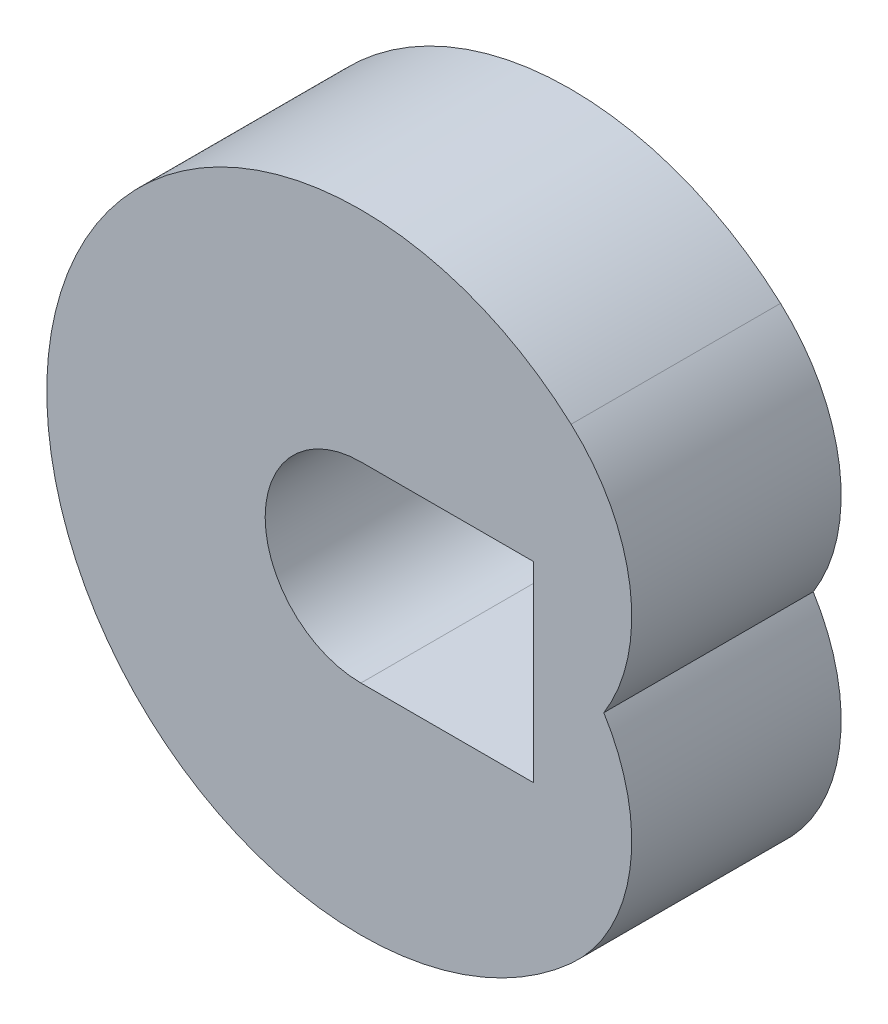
ISO-10303-21;
HEADER;
FILE_DESCRIPTION(('STEP AP214'),'2;1');
FILE_NAME('part.step','',(''),(''),'','','');
FILE_SCHEMA(('AUTOMOTIVE_DESIGN { 1 0 10303 214 1 1 1 1 }'));
ENDSEC;
DATA;
#1=APPLICATION_CONTEXT('core data for automotive mechanical design processes');
#2=APPLICATION_PROTOCOL_DEFINITION('international standard','automotive_design',2000,#1);
#3=PRODUCT_CONTEXT('',#1,'mechanical');
#4=PRODUCT('Part','Part','',(#3));
#5=PRODUCT_RELATED_PRODUCT_CATEGORY('part','',(#4));
#6=PRODUCT_DEFINITION_FORMATION('','',#4);
#7=PRODUCT_DEFINITION_CONTEXT('part definition',#1,'design');
#8=PRODUCT_DEFINITION('design','',#6,#7);
#9=PRODUCT_DEFINITION_SHAPE('','',#8);
#10=(LENGTH_UNIT() NAMED_UNIT(*) SI_UNIT(.MILLI.,.METRE.));
#11=(NAMED_UNIT(*) PLANE_ANGLE_UNIT() SI_UNIT($,.RADIAN.));
#12=(NAMED_UNIT(*) SI_UNIT($,.STERADIAN.) SOLID_ANGLE_UNIT());
#13=UNCERTAINTY_MEASURE_WITH_UNIT(LENGTH_MEASURE(1.E-05),#10,'distance_accuracy_value','');
#14=(GEOMETRIC_REPRESENTATION_CONTEXT(3) GLOBAL_UNCERTAINTY_ASSIGNED_CONTEXT((#13)) GLOBAL_UNIT_ASSIGNED_CONTEXT((#10,
#11,#12)) REPRESENTATION_CONTEXT('',''));
#15=CARTESIAN_POINT('',(0.,0.,0.));
#16=DIRECTION('',(0.,0.,1.));
#17=DIRECTION('',(1.,0.,0.));
#18=AXIS2_PLACEMENT_3D('',#15,#16,#17);
#19=CARTESIAN_POINT('',(167.282651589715,0.,400.));
#20=DIRECTION('',(0.,0.,-1.));
#21=DIRECTION('',(-1.,0.,0.));
#22=AXIS2_PLACEMENT_3D('',#19,#20,#21);
#23=PLANE('',#22);
#24=CARTESIAN_POINT('',(167.282651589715,185.786206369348,400.));
#25=DIRECTION('',(0.,0.,-1.));
#26=DIRECTION('',(-1.,0.,0.));
#27=AXIS2_PLACEMENT_3D('',#24,#25,#26);
#28=CIRCLE('',#27,350.);
#29=CARTESIAN_POINT('',(401.478363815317,445.886895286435,400.));
#30=VERTEX_POINT('',#29);
#31=CARTESIAN_POINT('',(463.902754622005,1.11022302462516E-13,400.));
#32=VERTEX_POINT('',#31);
#33=EDGE_CURVE('E155',#30,#32,#28,.T.);
#34=ORIENTED_EDGE('',*,*,#33,.F.);
#35=CARTESIAN_POINT('',(0.,0.,400.));
#36=DIRECTION('',(0.,0.,1.));
#37=DIRECTION('',(1.,0.,0.));
#38=AXIS2_PLACEMENT_3D('',#35,#36,#37);
#39=CIRCLE('',#38,600.);
#40=CARTESIAN_POINT('',(401.478363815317,-445.886895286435,400.));
#41=VERTEX_POINT('',#40);
#42=EDGE_CURVE('E161',#30,#41,#39,.T.);
#43=ORIENTED_EDGE('',*,*,#42,.T.);
#44=CARTESIAN_POINT('',(167.282651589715,-185.786206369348,400.));
#45=DIRECTION('',(0.,0.,1.));
#46=DIRECTION('',(1.,0.,0.));
#47=AXIS2_PLACEMENT_3D('',#44,#45,#46);
#48=CIRCLE('',#47,350.);
#49=EDGE_CURVE('E158',#41,#32,#48,.T.);
#50=ORIENTED_EDGE('',*,*,#49,.T.);
#51=EDGE_LOOP('',(#34,#43,#50));
#52=FACE_BOUND('',#51,.T.);
#53=CARTESIAN_POINT('',(0.,0.,400.));
#54=DIRECTION('',(0.,0.,1.));
#55=DIRECTION('',(1.,0.,0.));
#56=AXIS2_PLACEMENT_3D('',#53,#54,#55);
#57=CIRCLE('',#56,182.881257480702);
#58=CARTESIAN_POINT('',(0.,182.881257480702,400.));
#59=VERTEX_POINT('',#58);
#60=CARTESIAN_POINT('',(0.,-182.881257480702,400.));
#61=VERTEX_POINT('',#60);
#62=EDGE_CURVE('E118',#59,#61,#57,.T.);
#63=ORIENTED_EDGE('',*,*,#62,.F.);
#64=DIRECTION('',(1.,0.,0.));
#65=VECTOR('',#64,1.);
#66=CARTESIAN_POINT('',(0.,182.881257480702,400.));
#67=LINE('',#66,#65);
#68=CARTESIAN_POINT('',(330.,182.881257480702,400.));
#69=VERTEX_POINT('',#68);
#70=EDGE_CURVE('E140',#59,#69,#67,.T.);
#71=ORIENTED_EDGE('',*,*,#70,.T.);
#72=DIRECTION('',(0.,-1.,0.));
#73=VECTOR('',#72,1.);
#74=CARTESIAN_POINT('',(330.,182.881257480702,400.));
#75=LINE('',#74,#73);
#76=CARTESIAN_POINT('',(330.,-182.881257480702,400.));
#77=VERTEX_POINT('',#76);
#78=EDGE_CURVE('E77',#69,#77,#75,.T.);
#79=ORIENTED_EDGE('',*,*,#78,.T.);
#80=DIRECTION('',(-1.,0.,0.));
#81=VECTOR('',#80,1.);
#82=CARTESIAN_POINT('',(330.,-182.881257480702,400.));
#83=LINE('',#82,#81);
#84=EDGE_CURVE('E128',#77,#61,#83,.T.);
#85=ORIENTED_EDGE('',*,*,#84,.T.);
#86=EDGE_LOOP('',(#63,#71,#79,#85));
#87=FACE_BOUND('',#86,.T.);
#88=ADVANCED_FACE('F60',(#52,#87),#23,.F.);
#89=CARTESIAN_POINT('',(167.282651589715,0.,0.));
#90=DIRECTION('',(0.,0.,-1.));
#91=DIRECTION('',(-1.,0.,0.));
#92=AXIS2_PLACEMENT_3D('',#89,#90,#91);
#93=PLANE('',#92);
#94=CARTESIAN_POINT('',(167.282651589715,185.786206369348,0.));
#95=DIRECTION('',(0.,0.,-1.));
#96=DIRECTION('',(-1.,0.,0.));
#97=AXIS2_PLACEMENT_3D('',#94,#95,#96);
#98=CIRCLE('',#97,350.);
#99=CARTESIAN_POINT('',(401.478363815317,445.886895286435,0.));
#100=VERTEX_POINT('',#99);
#101=CARTESIAN_POINT('',(463.902754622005,1.11022302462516E-13,0.));
#102=VERTEX_POINT('',#101);
#103=EDGE_CURVE('E136',#100,#102,#98,.T.);
#104=ORIENTED_EDGE('',*,*,#103,.T.);
#105=CARTESIAN_POINT('',(167.282651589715,-185.786206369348,0.));
#106=DIRECTION('',(0.,0.,1.));
#107=DIRECTION('',(1.,0.,0.));
#108=AXIS2_PLACEMENT_3D('',#105,#106,#107);
#109=CIRCLE('',#108,350.);
#110=CARTESIAN_POINT('',(401.478363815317,-445.886895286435,0.));
#111=VERTEX_POINT('',#110);
#112=EDGE_CURVE('E165',#111,#102,#109,.T.);
#113=ORIENTED_EDGE('',*,*,#112,.F.);
#114=CARTESIAN_POINT('',(0.,0.,0.));
#115=DIRECTION('',(0.,0.,1.));
#116=DIRECTION('',(1.,0.,0.));
#117=AXIS2_PLACEMENT_3D('',#114,#115,#116);
#118=CIRCLE('',#117,600.);
#119=EDGE_CURVE('E159',#100,#111,#118,.T.);
#120=ORIENTED_EDGE('',*,*,#119,.F.);
#121=EDGE_LOOP('',(#104,#113,#120));
#122=FACE_BOUND('',#121,.T.);
#123=DIRECTION('',(1.,0.,0.));
#124=VECTOR('',#123,1.);
#125=CARTESIAN_POINT('',(0.,182.881257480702,0.));
#126=LINE('',#125,#124);
#127=CARTESIAN_POINT('',(0.,182.881257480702,0.));
#128=VERTEX_POINT('',#127);
#129=CARTESIAN_POINT('',(330.,182.881257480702,0.));
#130=VERTEX_POINT('',#129);
#131=EDGE_CURVE('E129',#128,#130,#126,.T.);
#132=ORIENTED_EDGE('',*,*,#131,.F.);
#133=CARTESIAN_POINT('',(0.,0.,0.));
#134=DIRECTION('',(0.,0.,1.));
#135=DIRECTION('',(1.,0.,0.));
#136=AXIS2_PLACEMENT_3D('',#133,#134,#135);
#137=CIRCLE('',#136,182.881257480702);
#138=CARTESIAN_POINT('',(0.,-182.881257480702,0.));
#139=VERTEX_POINT('',#138);
#140=EDGE_CURVE('E85',#128,#139,#137,.T.);
#141=ORIENTED_EDGE('',*,*,#140,.T.);
#142=DIRECTION('',(-1.,0.,0.));
#143=VECTOR('',#142,1.);
#144=CARTESIAN_POINT('',(330.,-182.881257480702,0.));
#145=LINE('',#144,#143);
#146=CARTESIAN_POINT('',(330.,-182.881257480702,0.));
#147=VERTEX_POINT('',#146);
#148=EDGE_CURVE('E135',#147,#139,#145,.T.);
#149=ORIENTED_EDGE('',*,*,#148,.F.);
#150=DIRECTION('',(0.,-1.,0.));
#151=VECTOR('',#150,1.);
#152=CARTESIAN_POINT('',(330.,182.881257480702,0.));
#153=LINE('',#152,#151);
#154=EDGE_CURVE('E146',#130,#147,#153,.T.);
#155=ORIENTED_EDGE('',*,*,#154,.F.);
#156=EDGE_LOOP('',(#132,#141,#149,#155));
#157=FACE_BOUND('',#156,.T.);
#158=ADVANCED_FACE('F180',(#122,#157),#93,.T.);
#159=CARTESIAN_POINT('',(167.282651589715,185.786206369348,400.));
#160=DIRECTION('',(0.,0.,-1.));
#161=DIRECTION('',(-1.,0.,0.));
#162=AXIS2_PLACEMENT_3D('',#159,#160,#161);
#163=CYLINDRICAL_SURFACE('',#162,350.);
#164=ORIENTED_EDGE('',*,*,#103,.F.);
#165=DIRECTION('',(0.,0.,-1.));
#166=VECTOR('',#165,1.);
#167=CARTESIAN_POINT('',(401.478363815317,445.886895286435,400.));
#168=LINE('',#167,#166);
#169=EDGE_CURVE('E12',#30,#100,#168,.T.);
#170=ORIENTED_EDGE('',*,*,#169,.F.);
#171=ORIENTED_EDGE('',*,*,#33,.T.);
#172=DIRECTION('',(0.,0.,-1.));
#173=VECTOR('',#172,1.);
#174=CARTESIAN_POINT('',(463.902754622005,1.11022302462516E-13,400.));
#175=LINE('',#174,#173);
#176=EDGE_CURVE('E64',#32,#102,#175,.T.);
#177=ORIENTED_EDGE('',*,*,#176,.T.);
#178=EDGE_LOOP('',(#164,#170,#171,#177));
#179=FACE_BOUND('',#178,.T.);
#180=ADVANCED_FACE('F62',(#179),#163,.T.);
#181=CARTESIAN_POINT('',(0.,0.,400.));
#182=DIRECTION('',(0.,0.,-1.));
#183=DIRECTION('',(-1.,0.,0.));
#184=AXIS2_PLACEMENT_3D('',#181,#182,#183);
#185=CYLINDRICAL_SURFACE('',#184,600.);
#186=ORIENTED_EDGE('',*,*,#119,.T.);
#187=DIRECTION('',(0.,0.,-1.));
#188=VECTOR('',#187,1.);
#189=CARTESIAN_POINT('',(401.478363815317,-445.886895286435,400.));
#190=LINE('',#189,#188);
#191=EDGE_CURVE('E69',#41,#111,#190,.T.);
#192=ORIENTED_EDGE('',*,*,#191,.F.);
#193=ORIENTED_EDGE('',*,*,#42,.F.);
#194=ORIENTED_EDGE('',*,*,#169,.T.);
#195=EDGE_LOOP('',(#186,#192,#193,#194));
#196=FACE_BOUND('',#195,.T.);
#197=ADVANCED_FACE('F183',(#196),#185,.T.);
#198=CARTESIAN_POINT('',(167.282651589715,-185.786206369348,400.));
#199=DIRECTION('',(0.,0.,-1.));
#200=DIRECTION('',(-1.,0.,0.));
#201=AXIS2_PLACEMENT_3D('',#198,#199,#200);
#202=CYLINDRICAL_SURFACE('',#201,350.);
#203=ORIENTED_EDGE('',*,*,#112,.T.);
#204=ORIENTED_EDGE('',*,*,#176,.F.);
#205=ORIENTED_EDGE('',*,*,#49,.F.);
#206=ORIENTED_EDGE('',*,*,#191,.T.);
#207=EDGE_LOOP('',(#203,#204,#205,#206));
#208=FACE_BOUND('',#207,.T.);
#209=ADVANCED_FACE('F177',(#208),#202,.T.);
#210=CARTESIAN_POINT('',(0.,0.,400.));
#211=DIRECTION('',(0.,0.,-1.));
#212=DIRECTION('',(-1.,0.,0.));
#213=AXIS2_PLACEMENT_3D('',#210,#211,#212);
#214=CYLINDRICAL_SURFACE('',#213,182.881257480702);
#215=ORIENTED_EDGE('',*,*,#140,.F.);
#216=DIRECTION('',(0.,0.,-1.));
#217=VECTOR('',#216,1.);
#218=CARTESIAN_POINT('',(0.,182.881257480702,400.));
#219=LINE('',#218,#217);
#220=EDGE_CURVE('E123',#59,#128,#219,.T.);
#221=ORIENTED_EDGE('',*,*,#220,.F.);
#222=ORIENTED_EDGE('',*,*,#62,.T.);
#223=DIRECTION('',(0.,0.,-1.));
#224=VECTOR('',#223,1.);
#225=CARTESIAN_POINT('',(0.,-182.881257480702,400.));
#226=LINE('',#225,#224);
#227=EDGE_CURVE('E121',#61,#139,#226,.T.);
#228=ORIENTED_EDGE('',*,*,#227,.T.);
#229=EDGE_LOOP('',(#215,#221,#222,#228));
#230=FACE_BOUND('',#229,.T.);
#231=ADVANCED_FACE('F120',(#230),#214,.F.);
#232=CARTESIAN_POINT('',(330.,-182.881257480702,400.));
#233=DIRECTION('',(0.,-1.,0.));
#234=DIRECTION('',(1.,0.,0.));
#235=AXIS2_PLACEMENT_3D('',#232,#233,#234);
#236=PLANE('',#235);
#237=ORIENTED_EDGE('',*,*,#148,.T.);
#238=ORIENTED_EDGE('',*,*,#227,.F.);
#239=ORIENTED_EDGE('',*,*,#84,.F.);
#240=DIRECTION('',(0.,0.,-1.));
#241=VECTOR('',#240,1.);
#242=CARTESIAN_POINT('',(330.,-182.881257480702,400.));
#243=LINE('',#242,#241);
#244=EDGE_CURVE('E137',#77,#147,#243,.T.);
#245=ORIENTED_EDGE('',*,*,#244,.T.);
#246=EDGE_LOOP('',(#237,#238,#239,#245));
#247=FACE_BOUND('',#246,.T.);
#248=ADVANCED_FACE('F133',(#247),#236,.F.);
#249=CARTESIAN_POINT('',(330.,182.881257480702,400.));
#250=DIRECTION('',(1.,0.,0.));
#251=DIRECTION('',(0.,0.,-1.));
#252=AXIS2_PLACEMENT_3D('',#249,#250,#251);
#253=PLANE('',#252);
#254=ORIENTED_EDGE('',*,*,#154,.T.);
#255=ORIENTED_EDGE('',*,*,#244,.F.);
#256=ORIENTED_EDGE('',*,*,#78,.F.);
#257=DIRECTION('',(0.,0.,-1.));
#258=VECTOR('',#257,1.);
#259=CARTESIAN_POINT('',(330.,182.881257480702,400.));
#260=LINE('',#259,#258);
#261=EDGE_CURVE('E152',#69,#130,#260,.T.);
#262=ORIENTED_EDGE('',*,*,#261,.T.);
#263=EDGE_LOOP('',(#254,#255,#256,#262));
#264=FACE_BOUND('',#263,.T.);
#265=ADVANCED_FACE('F203',(#264),#253,.F.);
#266=CARTESIAN_POINT('',(0.,182.881257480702,400.));
#267=DIRECTION('',(0.,1.,0.));
#268=DIRECTION('',(-1.,0.,0.));
#269=AXIS2_PLACEMENT_3D('',#266,#267,#268);
#270=PLANE('',#269);
#271=ORIENTED_EDGE('',*,*,#131,.T.);
#272=ORIENTED_EDGE('',*,*,#261,.F.);
#273=ORIENTED_EDGE('',*,*,#70,.F.);
#274=ORIENTED_EDGE('',*,*,#220,.T.);
#275=EDGE_LOOP('',(#271,#272,#273,#274));
#276=FACE_BOUND('',#275,.T.);
#277=ADVANCED_FACE('F207',(#276),#270,.F.);
#278=CLOSED_SHELL('',(#88,#158,#180,#197,#209,#231,#248,#265,#277));
#279=MANIFOLD_SOLID_BREP('B2',#278);
#280=ADVANCED_BREP_SHAPE_REPRESENTATION('',(#18,#279),#14);
#281=SHAPE_DEFINITION_REPRESENTATION(#9,#280);
ENDSEC;
END-ISO-10303-21;
